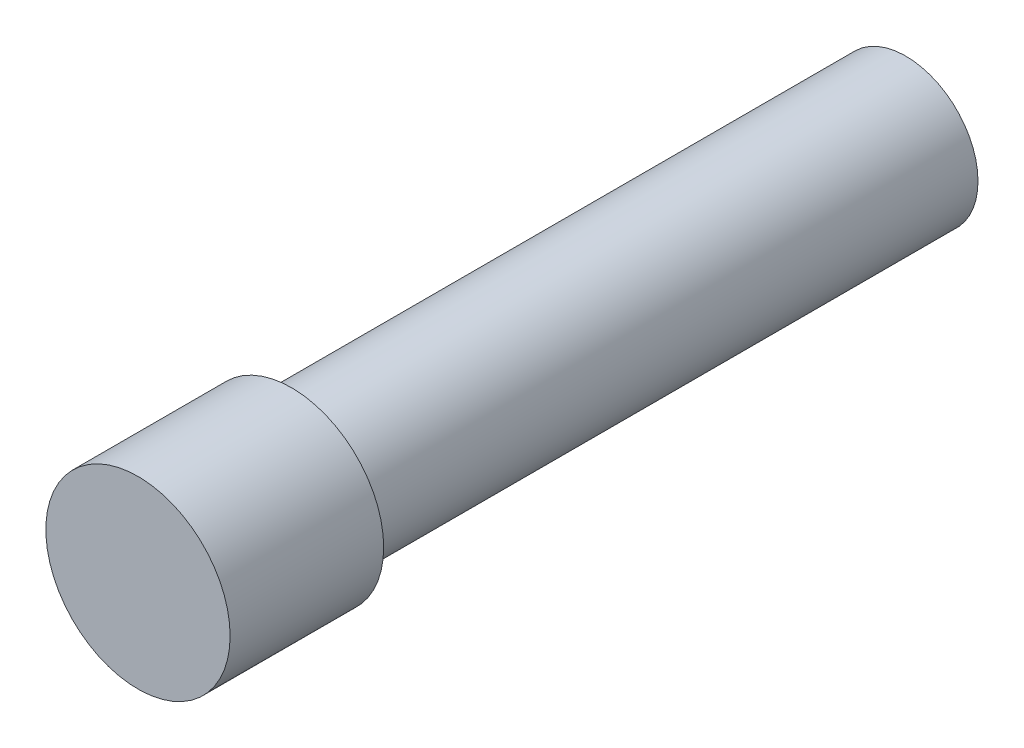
ISO-10303-21;
HEADER;
FILE_DESCRIPTION(('STEP AP214'),'2;1');
FILE_NAME('part.step','',(''),(''),'','','');
FILE_SCHEMA(('AUTOMOTIVE_DESIGN { 1 0 10303 214 1 1 1 1 }'));
ENDSEC;
DATA;
#1=APPLICATION_CONTEXT('core data for automotive mechanical design processes');
#2=APPLICATION_PROTOCOL_DEFINITION('international standard','automotive_design',2000,#1);
#3=PRODUCT_CONTEXT('',#1,'mechanical');
#4=PRODUCT('Part','Part','',(#3));
#5=PRODUCT_RELATED_PRODUCT_CATEGORY('part','',(#4));
#6=PRODUCT_DEFINITION_FORMATION('','',#4);
#7=PRODUCT_DEFINITION_CONTEXT('part definition',#1,'design');
#8=PRODUCT_DEFINITION('design','',#6,#7);
#9=PRODUCT_DEFINITION_SHAPE('','',#8);
#10=(LENGTH_UNIT() NAMED_UNIT(*) SI_UNIT(.MILLI.,.METRE.));
#11=(NAMED_UNIT(*) PLANE_ANGLE_UNIT() SI_UNIT($,.RADIAN.));
#12=(NAMED_UNIT(*) SI_UNIT($,.STERADIAN.) SOLID_ANGLE_UNIT());
#13=UNCERTAINTY_MEASURE_WITH_UNIT(LENGTH_MEASURE(1.E-05),#10,'distance_accuracy_value','');
#14=(GEOMETRIC_REPRESENTATION_CONTEXT(3) GLOBAL_UNCERTAINTY_ASSIGNED_CONTEXT((#13)) GLOBAL_UNIT_ASSIGNED_CONTEXT((#10,
#11,#12)) REPRESENTATION_CONTEXT('',''));
#15=CARTESIAN_POINT('',(0.,0.,0.));
#16=DIRECTION('',(0.,0.,1.));
#17=DIRECTION('',(1.,0.,0.));
#18=AXIS2_PLACEMENT_3D('',#15,#16,#17);
#19=CARTESIAN_POINT('',(0.,0.,12.5));
#20=DIRECTION('',(0.,0.,-1.));
#21=DIRECTION('',(-1.,0.,0.));
#22=AXIS2_PLACEMENT_3D('',#19,#20,#21);
#23=CYLINDRICAL_SURFACE('',#22,1.175);
#24=CARTESIAN_POINT('',(0.,0.,0.));
#25=DIRECTION('',(0.,0.,1.));
#26=DIRECTION('',(1.,0.,0.));
#27=AXIS2_PLACEMENT_3D('',#24,#25,#26);
#28=CIRCLE('',#27,1.175);
#29=CARTESIAN_POINT('',(1.175,0.,0.));
#30=VERTEX_POINT('',#29);
#31=EDGE_CURVE('E42',#30,#30,#28,.T.);
#32=ORIENTED_EDGE('',*,*,#31,.T.);
#33=EDGE_LOOP('',(#32));
#34=FACE_BOUND('',#33,.T.);
#35=CARTESIAN_POINT('',(0.,0.,10.));
#36=DIRECTION('',(0.,0.,1.));
#37=DIRECTION('',(1.,0.,0.));
#38=AXIS2_PLACEMENT_3D('',#35,#36,#37);
#39=CIRCLE('',#38,1.175);
#40=CARTESIAN_POINT('',(1.175,0.,10.));
#41=VERTEX_POINT('',#40);
#42=EDGE_CURVE('E10',#41,#41,#39,.T.);
#43=ORIENTED_EDGE('',*,*,#42,.F.);
#44=EDGE_LOOP('',(#43));
#45=FACE_BOUND('',#44,.T.);
#46=ADVANCED_FACE('F36',(#34,#45),#23,.T.);
#47=CARTESIAN_POINT('',(0.,0.,0.));
#48=DIRECTION('',(0.,0.,1.));
#49=DIRECTION('',(1.,0.,0.));
#50=AXIS2_PLACEMENT_3D('',#47,#48,#49);
#51=PLANE('',#50);
#52=ORIENTED_EDGE('',*,*,#31,.F.);
#53=EDGE_LOOP('',(#52));
#54=FACE_BOUND('',#53,.T.);
#55=ADVANCED_FACE('F61',(#54),#51,.F.);
#56=CARTESIAN_POINT('',(0.,0.,10.));
#57=DIRECTION('',(0.,0.,1.));
#58=DIRECTION('',(1.,0.,0.));
#59=AXIS2_PLACEMENT_3D('',#56,#57,#58);
#60=CYLINDRICAL_SURFACE('',#59,1.5);
#61=CARTESIAN_POINT('',(0.,0.,10.));
#62=DIRECTION('',(0.,0.,1.));
#63=DIRECTION('',(1.,0.,0.));
#64=AXIS2_PLACEMENT_3D('',#61,#62,#63);
#65=CIRCLE('',#64,1.5);
#66=CARTESIAN_POINT('',(1.5,0.,10.));
#67=VERTEX_POINT('',#66);
#68=EDGE_CURVE('E46',#67,#67,#65,.T.);
#69=ORIENTED_EDGE('',*,*,#68,.T.);
#70=EDGE_LOOP('',(#69));
#71=FACE_BOUND('',#70,.T.);
#72=CARTESIAN_POINT('',(0.,0.,12.5));
#73=DIRECTION('',(0.,0.,1.));
#74=DIRECTION('',(1.,0.,0.));
#75=AXIS2_PLACEMENT_3D('',#72,#73,#74);
#76=CIRCLE('',#75,1.5);
#77=CARTESIAN_POINT('',(1.5,0.,12.5));
#78=VERTEX_POINT('',#77);
#79=EDGE_CURVE('E50',#78,#78,#76,.T.);
#80=ORIENTED_EDGE('',*,*,#79,.F.);
#81=EDGE_LOOP('',(#80));
#82=FACE_BOUND('',#81,.T.);
#83=ADVANCED_FACE('F58',(#71,#82),#60,.T.);
#84=CARTESIAN_POINT('',(0.,0.,10.));
#85=DIRECTION('',(0.,0.,1.));
#86=DIRECTION('',(1.,0.,0.));
#87=AXIS2_PLACEMENT_3D('',#84,#85,#86);
#88=PLANE('',#87);
#89=ORIENTED_EDGE('',*,*,#42,.T.);
#90=EDGE_LOOP('',(#89));
#91=FACE_BOUND('',#90,.T.);
#92=ORIENTED_EDGE('',*,*,#68,.F.);
#93=EDGE_LOOP('',(#92));
#94=FACE_BOUND('',#93,.T.);
#95=ADVANCED_FACE('F60',(#91,#94),#88,.F.);
#96=CARTESIAN_POINT('',(0.,0.,12.5));
#97=DIRECTION('',(0.,0.,1.));
#98=DIRECTION('',(1.,0.,0.));
#99=AXIS2_PLACEMENT_3D('',#96,#97,#98);
#100=PLANE('',#99);
#101=ORIENTED_EDGE('',*,*,#79,.T.);
#102=EDGE_LOOP('',(#101));
#103=FACE_BOUND('',#102,.T.);
#104=ADVANCED_FACE('F56',(#103),#100,.T.);
#105=CLOSED_SHELL('',(#46,#55,#83,#95,#104));
#106=MANIFOLD_SOLID_BREP('B2',#105);
#107=ADVANCED_BREP_SHAPE_REPRESENTATION('',(#18,#106),#14);
#108=SHAPE_DEFINITION_REPRESENTATION(#9,#107);
ENDSEC;
END-ISO-10303-21;
